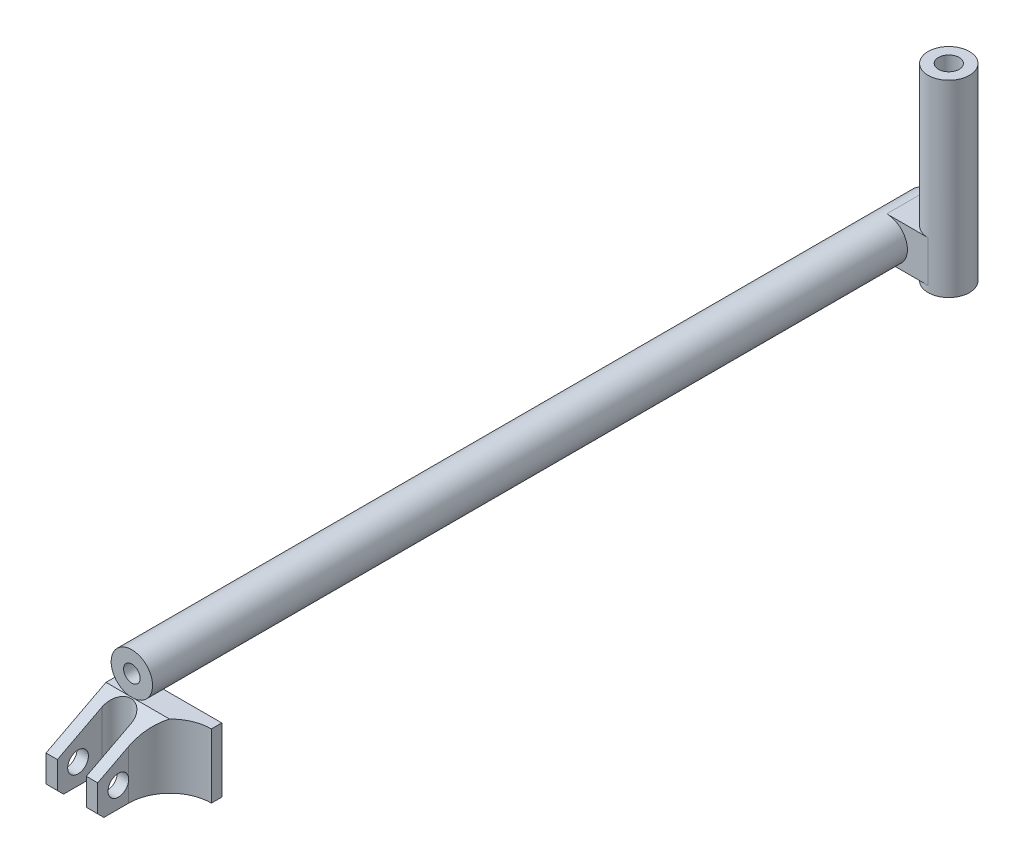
ISO-10303-21;
HEADER;
FILE_DESCRIPTION(('STEP AP214'),'2;1');
FILE_NAME('part.step','',(''),(''),'','','');
FILE_SCHEMA(('AUTOMOTIVE_DESIGN { 1 0 10303 214 1 1 1 1 }'));
ENDSEC;
DATA;
#1=APPLICATION_CONTEXT('core data for automotive mechanical design processes');
#2=APPLICATION_PROTOCOL_DEFINITION('international standard','automotive_design',2000,#1);
#3=PRODUCT_CONTEXT('',#1,'mechanical');
#4=PRODUCT('Part','Part','',(#3));
#5=PRODUCT_RELATED_PRODUCT_CATEGORY('part','',(#4));
#6=PRODUCT_DEFINITION_FORMATION('','',#4);
#7=PRODUCT_DEFINITION_CONTEXT('part definition',#1,'design');
#8=PRODUCT_DEFINITION('design','',#6,#7);
#9=PRODUCT_DEFINITION_SHAPE('','',#8);
#10=(LENGTH_UNIT() NAMED_UNIT(*) SI_UNIT(.MILLI.,.METRE.));
#11=(NAMED_UNIT(*) PLANE_ANGLE_UNIT() SI_UNIT($,.RADIAN.));
#12=(NAMED_UNIT(*) SI_UNIT($,.STERADIAN.) SOLID_ANGLE_UNIT());
#13=UNCERTAINTY_MEASURE_WITH_UNIT(LENGTH_MEASURE(1.E-05),#10,'distance_accuracy_value','');
#14=(GEOMETRIC_REPRESENTATION_CONTEXT(3) GLOBAL_UNCERTAINTY_ASSIGNED_CONTEXT((#13)) GLOBAL_UNIT_ASSIGNED_CONTEXT((#10,
#11,#12)) REPRESENTATION_CONTEXT('',''));
#15=CARTESIAN_POINT('',(0.,0.,0.));
#16=DIRECTION('',(0.,0.,1.));
#17=DIRECTION('',(1.,0.,0.));
#18=AXIS2_PLACEMENT_3D('',#15,#16,#17);
#19=CARTESIAN_POINT('',(25.,0.,0.));
#20=DIRECTION('',(0.,0.,1.));
#21=DIRECTION('',(-1.,0.,0.));
#22=AXIS2_PLACEMENT_3D('',#19,#20,#21);
#23=CYLINDRICAL_SURFACE('',#22,8.);
#24=CARTESIAN_POINT('',(25.,0.,365.));
#25=DIRECTION('',(0.,0.,-1.));
#26=DIRECTION('',(-1.,0.,0.));
#27=AXIS2_PLACEMENT_3D('',#24,#25,#26);
#28=CIRCLE('',#27,8.);
#29=CARTESIAN_POINT('',(17.,0.,365.));
#30=VERTEX_POINT('',#29);
#31=EDGE_CURVE('E36',#30,#30,#28,.F.);
#32=ORIENTED_EDGE('',*,*,#31,.T.);
#33=EDGE_LOOP('',(#32));
#34=FACE_BOUND('',#33,.T.);
#35=CARTESIAN_POINT('',(33.,1.11022302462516E-13,5.));
#36=CARTESIAN_POINT('',(32.9999996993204,-0.127079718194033,5.00000029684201));
#37=CARTESIAN_POINT('',(32.9969652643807,-0.254165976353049,5.00485122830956));
#38=CARTESIAN_POINT('',(32.9849016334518,-0.507365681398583,5.02418745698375));
#39=CARTESIAN_POINT('',(32.9758698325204,-0.633478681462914,5.03867694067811));
#40=CARTESIAN_POINT('',(32.9520184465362,-0.883879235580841,5.0771121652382));
#41=CARTESIAN_POINT('',(32.9371907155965,-1.00816396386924,5.10107121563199));
#42=CARTESIAN_POINT('',(32.9021008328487,-1.2538800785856,5.1581302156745));
#43=CARTESIAN_POINT('',(32.8818363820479,-1.37531023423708,5.19123403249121));
#44=CARTESIAN_POINT('',(32.8364650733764,-1.6138367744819,5.2659676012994));
#45=CARTESIAN_POINT('',(32.8113851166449,-1.73095311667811,5.30755006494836));
#46=CARTESIAN_POINT('',(32.7568549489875,-1.96091650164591,5.39889847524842));
#47=CARTESIAN_POINT('',(32.7274030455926,-2.07376186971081,5.44866759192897));
#48=CARTESIAN_POINT('',(32.6334070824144,-2.40491190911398,5.60949664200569));
#49=CARTESIAN_POINT('',(32.5631697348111,-2.61609848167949,5.73216345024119));
#50=CARTESIAN_POINT('',(32.4068029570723,-3.03193014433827,6.01555395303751));
#51=CARTESIAN_POINT('',(32.3198523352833,-3.23470598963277,6.17853453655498));
#52=CARTESIAN_POINT('',(32.1412401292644,-3.61195776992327,6.53289939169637));
#53=CARTESIAN_POINT('',(32.0495723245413,-3.78639500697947,6.72432183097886));
#54=CARTESIAN_POINT('',(31.9083621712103,-4.03551059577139,7.04428574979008));
#55=CARTESIAN_POINT('',(31.8577220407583,-4.12074022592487,7.16428713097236));
#56=CARTESIAN_POINT('',(31.7589964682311,-4.28074637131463,7.41215103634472));
#57=CARTESIAN_POINT('',(31.7109115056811,-4.35552092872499,7.54001502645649));
#58=CARTESIAN_POINT('',(31.6190767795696,-4.49385262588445,7.80288418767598));
#59=CARTESIAN_POINT('',(31.5753203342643,-4.55742717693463,7.93787784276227));
#60=CARTESIAN_POINT('',(31.4938515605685,-4.67278116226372,8.21462244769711));
#61=CARTESIAN_POINT('',(31.4561392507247,-4.72456056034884,8.35637341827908));
#62=CARTESIAN_POINT('',(31.3973773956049,-4.80367778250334,8.60813358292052));
#63=CARTESIAN_POINT('',(31.3745432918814,-4.83387146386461,8.71683605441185));
#64=CARTESIAN_POINT('',(31.3339131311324,-4.88698936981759,8.93691914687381));
#65=CARTESIAN_POINT('',(31.3161159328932,-4.90991524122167,9.04829915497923));
#66=CARTESIAN_POINT('',(31.2861900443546,-4.94817199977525,9.27297633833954));
#67=CARTESIAN_POINT('',(31.2740546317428,-4.96351189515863,9.38627107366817));
#68=CARTESIAN_POINT('',(31.2558765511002,-4.98640391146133,9.6141412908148));
#69=CARTESIAN_POINT('',(31.2498341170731,-4.99395573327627,9.72871682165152));
#70=CARTESIAN_POINT('',(31.2440762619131,-5.00115324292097,9.9585586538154));
#71=CARTESIAN_POINT('',(31.2443763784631,-5.0007795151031,10.0738259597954));
#72=CARTESIAN_POINT('',(31.2513301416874,-4.99208386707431,10.3039059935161));
#73=CARTESIAN_POINT('',(31.257986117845,-4.98375903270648,10.4187185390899));
#74=CARTESIAN_POINT('',(31.2773958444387,-4.95928874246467,10.6470210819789));
#75=CARTESIAN_POINT('',(31.2901515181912,-4.94314081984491,10.7605106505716));
#76=CARTESIAN_POINT('',(31.3212780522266,-4.90327193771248,10.9853862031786));
#77=CARTESIAN_POINT('',(31.3396512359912,-4.87954784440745,11.0967712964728));
#78=CARTESIAN_POINT('',(31.4012993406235,-4.79874186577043,11.4216199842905));
#79=CARTESIAN_POINT('',(31.4516270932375,-4.73140686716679,11.6312924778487));
#80=CARTESIAN_POINT('',(31.5658241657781,-4.57160139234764,12.0366820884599));
#81=CARTESIAN_POINT('',(31.6296982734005,-4.4791220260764,12.2323942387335));
#82=CARTESIAN_POINT('',(31.7781897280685,-4.25180409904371,12.6433146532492));
#83=CARTESIAN_POINT('',(31.8644530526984,-4.11227978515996,12.855335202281));
#84=CARTESIAN_POINT('',(32.0402390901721,-3.80349790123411,13.2553491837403));
#85=CARTESIAN_POINT('',(32.1297650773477,-3.63420977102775,13.443317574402));
#86=CARTESIAN_POINT('',(32.2682522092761,-3.34462792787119,13.7195685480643));
#87=CARTESIAN_POINT('',(32.3185662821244,-3.23332743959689,13.816742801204));
#88=CARTESIAN_POINT('',(32.4165140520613,-3.00184758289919,14.0013511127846));
#89=CARTESIAN_POINT('',(32.4641487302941,-2.88167150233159,14.0887887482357));
#90=CARTESIAN_POINT('',(32.5554827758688,-2.63291547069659,14.2532332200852));
#91=CARTESIAN_POINT('',(32.5991810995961,-2.5043333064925,14.3302372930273));
#92=CARTESIAN_POINT('',(32.6813840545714,-2.23953943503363,14.4729252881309));
#93=CARTESIAN_POINT('',(32.7198918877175,-2.10333250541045,14.5386161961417));
#94=CARTESIAN_POINT('',(32.7887019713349,-1.83158498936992,14.6546688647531));
#95=CARTESIAN_POINT('',(32.8193327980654,-1.69639792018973,14.7056622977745));
#96=CARTESIAN_POINT('',(32.874041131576,-1.42097512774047,14.796020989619));
#97=CARTESIAN_POINT('',(32.8981223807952,-1.28074233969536,14.8353928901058));
#98=CARTESIAN_POINT('',(32.9389934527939,-0.996484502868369,14.9018673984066));
#99=CARTESIAN_POINT('',(32.9557898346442,-0.852462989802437,14.9289810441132));
#100=CARTESIAN_POINT('',(32.9815729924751,-0.561915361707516,14.970490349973));
#101=CARTESIAN_POINT('',(32.9905611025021,-0.415389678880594,14.9848881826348));
#102=CARTESIAN_POINT('',(32.9996986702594,-0.143238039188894,14.999520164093));
#103=CARTESIAN_POINT('',(33.0009629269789,-0.0177414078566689,15.001540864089));
#104=CARTESIAN_POINT('',(32.997589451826,0.232966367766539,14.9961427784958));
#105=CARTESIAN_POINT('',(32.9929521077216,0.358177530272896,14.9887246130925));
#106=CARTESIAN_POINT('',(32.9778900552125,0.607327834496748,14.9645562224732));
#107=CARTESIAN_POINT('',(32.9674658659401,0.731267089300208,14.9478068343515));
#108=CARTESIAN_POINT('',(32.9410830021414,0.976969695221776,14.9052093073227));
#109=CARTESIAN_POINT('',(32.9251242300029,1.09873300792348,14.87936100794));
#110=CARTESIAN_POINT('',(32.8887734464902,1.33450834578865,14.8200905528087));
#111=CARTESIAN_POINT('',(32.8685811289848,1.44863666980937,14.7870073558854));
#112=CARTESIAN_POINT('',(32.8238453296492,1.6735023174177,14.7131109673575));
#113=CARTESIAN_POINT('',(32.7993003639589,1.7842384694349,14.6722951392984));
#114=CARTESIAN_POINT('',(32.7198451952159,2.11043845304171,14.5388502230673));
#115=CARTESIAN_POINT('',(32.6590855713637,2.32007565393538,14.4351772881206));
#116=CARTESIAN_POINT('',(32.5195949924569,2.74037159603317,14.1899279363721));
#117=CARTESIAN_POINT('',(32.439669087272,2.94899750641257,14.0455818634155));
#118=CARTESIAN_POINT('',(32.2722803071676,3.34056091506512,13.7288284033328));
#119=CARTESIAN_POINT('',(32.1848091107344,3.52346945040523,13.5563898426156));
#120=CARTESIAN_POINT('',(31.9962341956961,3.88590040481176,13.1594550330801));
#121=CARTESIAN_POINT('',(31.8949947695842,4.06107692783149,12.9310356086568));
#122=CARTESIAN_POINT('',(31.7026710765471,4.37121122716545,12.4445124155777));
#123=CARTESIAN_POINT('',(31.6115798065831,4.50619684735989,12.186429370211));
#124=CARTESIAN_POINT('',(31.469339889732,4.70739703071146,11.7011860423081));
#125=CARTESIAN_POINT('',(31.4138210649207,4.78209607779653,11.4788842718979));
#126=CARTESIAN_POINT('',(31.3465659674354,4.87056932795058,11.1364345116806));
#127=CARTESIAN_POINT('',(31.3268205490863,4.89612834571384,11.0208098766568));
#128=CARTESIAN_POINT('',(31.2933595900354,4.93906627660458,10.787213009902));
#129=CARTESIAN_POINT('',(31.279641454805,4.95644870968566,10.6692418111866));
#130=CARTESIAN_POINT('',(31.2587264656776,4.98283345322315,10.431062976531));
#131=CARTESIAN_POINT('',(31.2515693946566,4.99178464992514,10.3108461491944));
#132=CARTESIAN_POINT('',(31.2442275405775,5.00096567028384,10.0698650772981));
#133=CARTESIAN_POINT('',(31.2440427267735,5.00119553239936,9.94910083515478));
#134=CARTESIAN_POINT('',(31.250658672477,4.99292458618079,9.70802447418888));
#135=CARTESIAN_POINT('',(31.257461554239,4.98442112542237,9.58771250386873));
#136=CARTESIAN_POINT('',(31.2777455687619,4.95884706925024,9.34860633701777));
#137=CARTESIAN_POINT('',(31.2912266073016,4.94177659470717,9.22981211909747));
#138=CARTESIAN_POINT('',(31.3382277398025,4.88153513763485,8.89602861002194));
#139=CARTESIAN_POINT('',(31.3790757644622,4.82847742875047,8.68376223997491));
#140=CARTESIAN_POINT('',(31.4766977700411,4.69670428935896,8.27142029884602));
#141=CARTESIAN_POINT('',(31.5334783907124,4.61797815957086,8.07134985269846));
#142=CARTESIAN_POINT('',(31.666557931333,4.42410573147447,7.65762443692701));
#143=CARTESIAN_POINT('',(31.7444924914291,4.30533683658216,7.4461960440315));
#144=CARTESIAN_POINT('',(31.9067049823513,4.0400096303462,7.04424929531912));
#145=CARTESIAN_POINT('',(31.990988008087,3.8934288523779,6.85374804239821));
#146=CARTESIAN_POINT('',(32.1760899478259,3.54264024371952,6.45991603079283));
#147=CARTESIAN_POINT('',(32.2768764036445,3.33276887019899,6.26152210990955));
#148=CARTESIAN_POINT('',(32.420183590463,2.99268031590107,5.99189976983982));
#149=CARTESIAN_POINT('',(32.4666796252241,2.8749841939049,5.90662168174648));
#150=CARTESIAN_POINT('',(32.5558801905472,2.63162062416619,5.7460851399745));
#151=CARTESIAN_POINT('',(32.5985866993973,2.5059573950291,5.67082144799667));
#152=CARTESIAN_POINT('',(32.6791688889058,2.24695585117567,5.53089372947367));
#153=CARTESIAN_POINT('',(32.7170326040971,2.11359966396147,5.46625584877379));
#154=CARTESIAN_POINT('',(32.7867074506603,1.84039127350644,5.34864993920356));
#155=CARTESIAN_POINT('',(32.818522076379,1.70054287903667,5.29567517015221));
#156=CARTESIAN_POINT('',(32.8750664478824,1.41574969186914,5.20228711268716));
#157=CARTESIAN_POINT('',(32.8998152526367,1.27081981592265,5.16184000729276));
#158=CARTESIAN_POINT('',(32.9415135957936,0.976912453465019,5.09404896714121));
#159=CARTESIAN_POINT('',(32.9584688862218,0.827938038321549,5.06669536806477));
#160=CARTESIAN_POINT('',(32.9807660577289,0.56570803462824,5.03081849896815));
#161=CARTESIAN_POINT('',(32.9879654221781,0.453012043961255,5.01927449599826));
#162=CARTESIAN_POINT('',(32.9975826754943,0.226879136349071,5.00386487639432));
#163=CARTESIAN_POINT('',(33.0000002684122,0.113442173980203,4.99999973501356));
#164=CARTESIAN_POINT('',(33.,1.11022302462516E-13,5.));
#165=B_SPLINE_CURVE_WITH_KNOTS('',3,(#35,#36,#37,#38,#39,#40,#41,#42,#43,#44,#45,#46,#47,#48,
#49,#50,#51,#52,#53,#54,#55,#56,#57,#58,#59,#60,#61,#62,#63,#64,#65,#66,#67,#68,#69,#70,#71,#72,
#73,#74,#75,#76,#77,#78,#79,#80,#81,#82,#83,#84,#85,#86,#87,#88,#89,#90,#91,#92,#93,#94,#95,#96,
#97,#98,#99,#100,#101,#102,#103,#104,#105,#106,#107,#108,#109,#110,#111,#112,#113,#114,#115,
#116,#117,#118,#119,#120,#121,#122,#123,#124,#125,#126,#127,#128,#129,#130,#131,#132,#133,#134,
#135,#136,#137,#138,#139,#140,#141,#142,#143,#144,#145,#146,#147,#148,#149,#150,#151,#152,#153,
#154,#155,#156,#157,#158,#159,#160,#161,#162,#163,#164),.UNSPECIFIED.,.T.,.F.,(4,2,2,2,2,2,2,2,
2,2,2,2,2,2,2,2,2,2,2,2,2,2,2,2,2,2,2,2,2,2,2,2,2,2,2,2,2,2,2,2,2,2,2,2,2,2,2,2,2,2,2,2,2,2,2,2,
2,2,2,2,2,2,2,2,4),(0.,0.381122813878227,0.762411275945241,1.14423755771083,1.52622555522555,
1.90613865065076,2.28619920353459,3.04547146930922,3.86537873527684,4.68639638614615,
5.15288943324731,5.61946971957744,6.08531814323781,6.55116799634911,6.89615022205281,
7.24105422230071,7.58554766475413,7.93005433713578,8.27540506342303,8.62088241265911,
8.96646876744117,9.31219825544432,9.98712845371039,10.6622975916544,11.463592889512,
12.2657157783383,12.7334704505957,13.2010527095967,13.6687585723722,14.1361745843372,
14.5786070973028,15.0207862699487,15.4625664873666,15.9042712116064,16.280349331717,
16.6564027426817,17.0324224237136,17.4084487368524,17.7696430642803,18.1309607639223,
18.8530325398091,19.6479898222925,20.4438353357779,21.355208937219,22.2659496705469,
22.9857781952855,23.3455439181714,23.705154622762,24.0669316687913,24.4287071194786,
24.7905924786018,25.1524727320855,25.8172983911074,26.4824015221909,27.2437925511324,
28.005801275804,28.9187931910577,29.3761295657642,29.8332257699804,30.2914303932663,
30.749369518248,31.2060614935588,31.6624158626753,32.0026174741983,32.3428401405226),.UNSPECIFIED.);
#166=CARTESIAN_POINT('',(33.,1.11022302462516E-13,5.));
#167=VERTEX_POINT('',#166);
#168=EDGE_CURVE('E196',#167,#167,#165,.T.);
#169=ORIENTED_EDGE('',*,*,#168,.F.);
#170=EDGE_LOOP('',(#169));
#171=FACE_BOUND('',#170,.T.);
#172=CARTESIAN_POINT('',(25.,0.,3.));
#173=DIRECTION('',(0.,0.,1.));
#174=DIRECTION('',(1.,0.,0.));
#175=AXIS2_PLACEMENT_3D('',#172,#173,#174);
#176=CIRCLE('',#175,8.);
#177=CARTESIAN_POINT('',(33.,0.,3.));
#178=VERTEX_POINT('',#177);
#179=EDGE_CURVE('E11',#178,#178,#176,.F.);
#180=ORIENTED_EDGE('',*,*,#179,.T.);
#181=EDGE_LOOP('',(#180));
#182=FACE_BOUND('',#181,.T.);
#183=ADVANCED_FACE('F28',(#34,#171,#182),#23,.F.);
#184=CARTESIAN_POINT('',(50.,1.11022302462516E-13,10.));
#185=DIRECTION('',(-1.,0.,0.));
#186=DIRECTION('',(0.,0.,-1.));
#187=AXIS2_PLACEMENT_3D('',#184,#185,#186);
#188=CYLINDRICAL_SURFACE('',#187,5.);
#189=ORIENTED_EDGE('',*,*,#168,.T.);
#190=EDGE_LOOP('',(#189));
#191=FACE_BOUND('',#190,.T.);
#192=CARTESIAN_POINT('',(45.,1.11022302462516E-13,10.));
#193=DIRECTION('',(0.707106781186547,0.707106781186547,0.));
#194=DIRECTION('',(-0.707106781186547,0.707106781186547,0.));
#195=AXIS2_PLACEMENT_3D('',#192,#193,#194);
#196=ELLIPSE('',#195,7.07106781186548,5.);
#197=CARTESIAN_POINT('',(45.,1.11022302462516E-13,15.));
#198=VERTEX_POINT('',#197);
#199=CARTESIAN_POINT('',(45.,1.11022302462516E-13,5.));
#200=VERTEX_POINT('',#199);
#201=EDGE_CURVE('E183',#198,#200,#196,.F.);
#202=ORIENTED_EDGE('',*,*,#201,.F.);
#203=CARTESIAN_POINT('',(45.,1.11022302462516E-13,10.));
#204=DIRECTION('',(0.707106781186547,-0.707106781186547,0.));
#205=DIRECTION('',(-0.707106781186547,-0.707106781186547,0.));
#206=AXIS2_PLACEMENT_3D('',#203,#204,#205);
#207=ELLIPSE('',#206,7.07106781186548,5.);
#208=EDGE_CURVE('E176',#200,#198,#207,.F.);
#209=ORIENTED_EDGE('',*,*,#208,.F.);
#210=EDGE_LOOP('',(#202,#209));
#211=FACE_BOUND('',#210,.T.);
#212=ADVANCED_FACE('F386',(#191,#211),#188,.F.);
#213=CARTESIAN_POINT('',(57.5,-25.,414.));
#214=DIRECTION('',(0.,0.,1.));
#215=DIRECTION('',(-1.,0.,0.));
#216=AXIS2_PLACEMENT_3D('',#213,#214,#215);
#217=PLANE('',#216);
#218=DIRECTION('',(0.,1.,0.));
#219=VECTOR('',#218,1.);
#220=CARTESIAN_POINT('',(18.,-25.,414.));
#221=LINE('',#220,#219);
#222=CARTESIAN_POINT('',(18.,-38.,414.));
#223=VERTEX_POINT('',#222);
#224=CARTESIAN_POINT('',(18.,-25.,414.));
#225=VERTEX_POINT('',#224);
#226=EDGE_CURVE('E234',#223,#225,#221,.T.);
#227=ORIENTED_EDGE('',*,*,#226,.T.);
#228=DIRECTION('',(-1.,0.,0.));
#229=VECTOR('',#228,1.);
#230=CARTESIAN_POINT('',(57.5,-25.,414.));
#231=LINE('',#230,#229);
#232=CARTESIAN_POINT('',(12.5,-25.,414.));
#233=VERTEX_POINT('',#232);
#234=EDGE_CURVE('E286',#225,#233,#231,.T.);
#235=ORIENTED_EDGE('',*,*,#234,.T.);
#236=DIRECTION('',(0.,-1.,0.));
#237=VECTOR('',#236,1.);
#238=CARTESIAN_POINT('',(12.5,-25.,414.));
#239=LINE('',#238,#237);
#240=CARTESIAN_POINT('',(12.5,-38.,414.));
#241=VERTEX_POINT('',#240);
#242=EDGE_CURVE('E259',#233,#241,#239,.T.);
#243=ORIENTED_EDGE('',*,*,#242,.T.);
#244=DIRECTION('',(-1.,0.,0.));
#245=VECTOR('',#244,1.);
#246=CARTESIAN_POINT('',(57.5,-38.,414.));
#247=LINE('',#246,#245);
#248=EDGE_CURVE('E354',#223,#241,#247,.T.);
#249=ORIENTED_EDGE('',*,*,#248,.F.);
#250=EDGE_LOOP('',(#227,#235,#243,#249));
#251=FACE_BOUND('',#250,.T.);
#252=ADVANCED_FACE('F445',(#251),#217,.T.);
#253=CARTESIAN_POINT('',(45.,10.,10.));
#254=DIRECTION('',(0.,1.,0.));
#255=DIRECTION('',(0.,0.,1.));
#256=AXIS2_PLACEMENT_3D('',#253,#254,#255);
#257=PLANE('',#256);
#258=DIRECTION('',(1.,0.,0.));
#259=VECTOR('',#258,1.);
#260=CARTESIAN_POINT('',(45.,10.,0.));
#261=LINE('',#260,#259);
#262=CARTESIAN_POINT('',(25.,10.,0.));
#263=VERTEX_POINT('',#262);
#264=CARTESIAN_POINT('',(45.,10.,0.));
#265=VERTEX_POINT('',#264);
#266=EDGE_CURVE('E321',#263,#265,#261,.T.);
#267=ORIENTED_EDGE('',*,*,#266,.F.);
#268=DIRECTION('',(0.,0.,-1.));
#269=VECTOR('',#268,1.);
#270=CARTESIAN_POINT('',(25.,10.,0.));
#271=LINE('',#270,#269);
#272=CARTESIAN_POINT('',(25.,10.,20.));
#273=VERTEX_POINT('',#272);
#274=EDGE_CURVE('E318',#273,#263,#271,.T.);
#275=ORIENTED_EDGE('',*,*,#274,.F.);
#276=DIRECTION('',(-1.,0.,0.));
#277=VECTOR('',#276,1.);
#278=CARTESIAN_POINT('',(45.,10.,20.));
#279=LINE('',#278,#277);
#280=CARTESIAN_POINT('',(45.,10.,20.));
#281=VERTEX_POINT('',#280);
#282=EDGE_CURVE('E315',#281,#273,#279,.T.);
#283=ORIENTED_EDGE('',*,*,#282,.F.);
#284=CARTESIAN_POINT('',(45.,10.,10.));
#285=DIRECTION('',(0.,-1.,0.));
#286=DIRECTION('',(0.,0.,1.));
#287=AXIS2_PLACEMENT_3D('',#284,#285,#286);
#288=CIRCLE('',#287,10.);
#289=EDGE_CURVE('E294',#281,#265,#288,.T.);
#290=ORIENTED_EDGE('',*,*,#289,.T.);
#291=EDGE_LOOP('',(#267,#275,#283,#290));
#292=FACE_BOUND('',#291,.T.);
#293=ADVANCED_FACE('F463',(#292),#257,.T.);
#294=CARTESIAN_POINT('',(45.,-10.,10.));
#295=DIRECTION('',(0.,1.,0.));
#296=DIRECTION('',(0.,0.,1.));
#297=AXIS2_PLACEMENT_3D('',#294,#295,#296);
#298=PLANE('',#297);
#299=CARTESIAN_POINT('',(45.,-10.,10.));
#300=DIRECTION('',(0.,1.,0.));
#301=DIRECTION('',(0.,0.,-1.));
#302=AXIS2_PLACEMENT_3D('',#299,#300,#301);
#303=CIRCLE('',#302,10.);
#304=CARTESIAN_POINT('',(45.,-10.,0.));
#305=VERTEX_POINT('',#304);
#306=CARTESIAN_POINT('',(45.,-10.,20.));
#307=VERTEX_POINT('',#306);
#308=EDGE_CURVE('E300',#305,#307,#303,.T.);
#309=ORIENTED_EDGE('',*,*,#308,.T.);
#310=DIRECTION('',(-1.,0.,0.));
#311=VECTOR('',#310,1.);
#312=CARTESIAN_POINT('',(45.,-10.,20.));
#313=LINE('',#312,#311);
#314=CARTESIAN_POINT('',(25.,-10.,20.));
#315=VERTEX_POINT('',#314);
#316=EDGE_CURVE('E306',#307,#315,#313,.T.);
#317=ORIENTED_EDGE('',*,*,#316,.T.);
#318=DIRECTION('',(0.,0.,-1.));
#319=VECTOR('',#318,1.);
#320=CARTESIAN_POINT('',(25.,-10.,0.));
#321=LINE('',#320,#319);
#322=CARTESIAN_POINT('',(25.,-10.,0.));
#323=VERTEX_POINT('',#322);
#324=EDGE_CURVE('E309',#315,#323,#321,.T.);
#325=ORIENTED_EDGE('',*,*,#324,.T.);
#326=DIRECTION('',(1.,0.,0.));
#327=VECTOR('',#326,1.);
#328=CARTESIAN_POINT('',(45.,-10.,0.));
#329=LINE('',#328,#327);
#330=EDGE_CURVE('E312',#323,#305,#329,.T.);
#331=ORIENTED_EDGE('',*,*,#330,.T.);
#332=EDGE_LOOP('',(#309,#317,#325,#331));
#333=FACE_BOUND('',#332,.T.);
#334=ADVANCED_FACE('F460',(#333),#298,.F.);
#335=CARTESIAN_POINT('',(25.,0.,385.));
#336=DIRECTION('',(0.,0.,-1.));
#337=DIRECTION('',(1.,0.,0.));
#338=AXIS2_PLACEMENT_3D('',#335,#336,#337);
#339=CYLINDRICAL_SURFACE('',#338,10.);
#340=CARTESIAN_POINT('',(25.,0.,385.));
#341=DIRECTION('',(0.,0.,-1.));
#342=DIRECTION('',(-1.,0.,0.));
#343=AXIS2_PLACEMENT_3D('',#340,#341,#342);
#344=CIRCLE('',#343,10.);
#345=CARTESIAN_POINT('',(23.7309886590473,-9.91915370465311,385.));
#346=VERTEX_POINT('',#345);
#347=CARTESIAN_POINT('',(26.2690113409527,-9.91915370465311,385.));
#348=VERTEX_POINT('',#347);
#349=EDGE_CURVE('E330',#346,#348,#344,.T.);
#350=ORIENTED_EDGE('',*,*,#349,.T.);
#351=DIRECTION('',(0.,0.,-1.));
#352=VECTOR('',#351,1.);
#353=CARTESIAN_POINT('',(26.2690113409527,-9.91915370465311,385.));
#354=LINE('',#353,#352);
#355=CARTESIAN_POINT('',(26.2690113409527,-9.9191537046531,374.));
#356=VERTEX_POINT('',#355);
#357=EDGE_CURVE('E278',#356,#348,#354,.F.);
#358=ORIENTED_EDGE('',*,*,#357,.F.);
#359=CARTESIAN_POINT('',(25.,0.,374.));
#360=DIRECTION('',(0.,0.,1.));
#361=DIRECTION('',(1.,0.,0.));
#362=AXIS2_PLACEMENT_3D('',#359,#360,#361);
#363=CIRCLE('',#362,10.);
#364=CARTESIAN_POINT('',(23.7309886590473,-9.9191537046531,374.));
#365=VERTEX_POINT('',#364);
#366=EDGE_CURVE('E338',#365,#356,#363,.T.);
#367=ORIENTED_EDGE('',*,*,#366,.F.);
#368=DIRECTION('',(0.,0.,-1.));
#369=VECTOR('',#368,1.);
#370=CARTESIAN_POINT('',(23.7309886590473,-9.91915370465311,385.));
#371=LINE('',#370,#369);
#372=EDGE_CURVE('E291',#346,#365,#371,.T.);
#373=ORIENTED_EDGE('',*,*,#372,.F.);
#374=EDGE_LOOP('',(#350,#358,#367,#373));
#375=FACE_BOUND('',#374,.T.);
#376=ORIENTED_EDGE('',*,*,#274,.T.);
#377=CARTESIAN_POINT('',(25.,0.,0.));
#378=DIRECTION('',(0.,0.,-1.));
#379=DIRECTION('',(-1.,0.,0.));
#380=AXIS2_PLACEMENT_3D('',#377,#378,#379);
#381=CIRCLE('',#380,10.);
#382=EDGE_CURVE('E328',#323,#263,#381,.T.);
#383=ORIENTED_EDGE('',*,*,#382,.F.);
#384=ORIENTED_EDGE('',*,*,#324,.F.);
#385=CARTESIAN_POINT('',(25.,0.,20.));
#386=DIRECTION('',(0.,0.,1.));
#387=DIRECTION('',(1.,0.,0.));
#388=AXIS2_PLACEMENT_3D('',#385,#386,#387);
#389=CIRCLE('',#388,10.);
#390=EDGE_CURVE('E333',#315,#273,#389,.T.);
#391=ORIENTED_EDGE('',*,*,#390,.T.);
#392=EDGE_LOOP('',(#376,#383,#384,#391));
#393=FACE_BOUND('',#392,.T.);
#394=ADVANCED_FACE('F30',(#375,#393),#339,.T.);
#395=CARTESIAN_POINT('',(25.,0.,385.));
#396=DIRECTION('',(0.,0.,1.));
#397=DIRECTION('',(-1.,0.,0.));
#398=AXIS2_PLACEMENT_3D('',#395,#396,#397);
#399=PLANE('',#398);
#400=DIRECTION('',(1.,0.,0.));
#401=VECTOR('',#400,1.);
#402=CARTESIAN_POINT('',(25.,-9.91915370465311,385.));
#403=LINE('',#402,#401);
#404=EDGE_CURVE('E335',#346,#348,#403,.T.);
#405=ORIENTED_EDGE('',*,*,#404,.T.);
#406=ORIENTED_EDGE('',*,*,#349,.F.);
#407=EDGE_LOOP('',(#405,#406));
#408=FACE_BOUND('',#407,.T.);
#409=CARTESIAN_POINT('',(25.,0.,385.));
#410=DIRECTION('',(0.,0.,-1.));
#411=DIRECTION('',(-1.,0.,0.));
#412=AXIS2_PLACEMENT_3D('',#409,#410,#411);
#413=CIRCLE('',#412,4.);
#414=CARTESIAN_POINT('',(21.,0.,385.));
#415=VERTEX_POINT('',#414);
#416=EDGE_CURVE('E202',#415,#415,#413,.T.);
#417=ORIENTED_EDGE('',*,*,#416,.T.);
#418=EDGE_LOOP('',(#417));
#419=FACE_BOUND('',#418,.T.);
#420=ADVANCED_FACE('F477',(#408,#419),#399,.T.);
#421=CARTESIAN_POINT('',(25.,0.,0.));
#422=DIRECTION('',(0.,0.,1.));
#423=DIRECTION('',(-1.,0.,0.));
#424=AXIS2_PLACEMENT_3D('',#421,#422,#423);
#425=PLANE('',#424);
#426=ORIENTED_EDGE('',*,*,#382,.T.);
#427=ORIENTED_EDGE('',*,*,#266,.T.);
#428=DIRECTION('',(0.,-1.,0.));
#429=VECTOR('',#428,1.);
#430=CARTESIAN_POINT('',(45.,10.,0.));
#431=LINE('',#430,#429);
#432=EDGE_CURVE('E324',#265,#305,#431,.T.);
#433=ORIENTED_EDGE('',*,*,#432,.T.);
#434=ORIENTED_EDGE('',*,*,#330,.F.);
#435=EDGE_LOOP('',(#426,#427,#433,#434));
#436=FACE_BOUND('',#435,.T.);
#437=ADVANCED_FACE('F471',(#436),#425,.F.);
#438=CARTESIAN_POINT('',(45.,10.,20.));
#439=DIRECTION('',(0.,0.,-1.));
#440=DIRECTION('',(1.,0.,0.));
#441=AXIS2_PLACEMENT_3D('',#438,#439,#440);
#442=PLANE('',#441);
#443=ORIENTED_EDGE('',*,*,#316,.F.);
#444=DIRECTION('',(0.,-1.,0.));
#445=VECTOR('',#444,1.);
#446=CARTESIAN_POINT('',(45.,10.,20.));
#447=LINE('',#446,#445);
#448=EDGE_CURVE('E326',#281,#307,#447,.T.);
#449=ORIENTED_EDGE('',*,*,#448,.F.);
#450=ORIENTED_EDGE('',*,*,#282,.T.);
#451=ORIENTED_EDGE('',*,*,#390,.F.);
#452=EDGE_LOOP('',(#443,#449,#450,#451));
#453=FACE_BOUND('',#452,.T.);
#454=ADVANCED_FACE('F468',(#453),#442,.F.);
#455=CARTESIAN_POINT('',(45.,10.,10.));
#456=DIRECTION('',(0.,-1.,0.));
#457=DIRECTION('',(0.,0.,-1.));
#458=AXIS2_PLACEMENT_3D('',#455,#456,#457);
#459=CYLINDRICAL_SURFACE('',#458,10.);
#460=ORIENTED_EDGE('',*,*,#432,.F.);
#461=ORIENTED_EDGE('',*,*,#289,.F.);
#462=ORIENTED_EDGE('',*,*,#448,.T.);
#463=ORIENTED_EDGE('',*,*,#308,.F.);
#464=EDGE_LOOP('',(#460,#461,#462,#463));
#465=FACE_BOUND('',#464,.T.);
#466=CARTESIAN_POINT('',(45.,-13.,10.));
#467=DIRECTION('',(0.,1.,0.));
#468=DIRECTION('',(0.,0.,-1.));
#469=AXIS2_PLACEMENT_3D('',#466,#467,#468);
#470=CIRCLE('',#469,10.);
#471=CARTESIAN_POINT('',(45.,-13.,0.));
#472=VERTEX_POINT('',#471);
#473=EDGE_CURVE('E303',#472,#472,#470,.T.);
#474=ORIENTED_EDGE('',*,*,#473,.T.);
#475=EDGE_LOOP('',(#474));
#476=FACE_BOUND('',#475,.T.);
#477=CARTESIAN_POINT('',(45.,78.,10.));
#478=DIRECTION('',(0.,-1.,0.));
#479=DIRECTION('',(0.,0.,1.));
#480=AXIS2_PLACEMENT_3D('',#477,#478,#479);
#481=CIRCLE('',#480,10.);
#482=CARTESIAN_POINT('',(45.,78.,20.));
#483=VERTEX_POINT('',#482);
#484=EDGE_CURVE('E297',#483,#483,#481,.T.);
#485=ORIENTED_EDGE('',*,*,#484,.T.);
#486=EDGE_LOOP('',(#485));
#487=FACE_BOUND('',#486,.T.);
#488=ADVANCED_FACE('F458',(#465,#476,#487),#459,.T.);
#489=CARTESIAN_POINT('',(45.,-13.,10.));
#490=DIRECTION('',(0.,-1.,0.));
#491=DIRECTION('',(0.,0.,-1.));
#492=AXIS2_PLACEMENT_3D('',#489,#490,#491);
#493=PLANE('',#492);
#494=ORIENTED_EDGE('',*,*,#473,.F.);
#495=EDGE_LOOP('',(#494));
#496=FACE_BOUND('',#495,.T.);
#497=ADVANCED_FACE('F454',(#496),#493,.T.);
#498=CARTESIAN_POINT('',(45.,78.,10.));
#499=DIRECTION('',(0.,1.,0.));
#500=DIRECTION('',(0.,0.,1.));
#501=AXIS2_PLACEMENT_3D('',#498,#499,#500);
#502=PLANE('',#501);
#503=CARTESIAN_POINT('',(45.,78.,10.));
#504=DIRECTION('',(0.,-1.,0.));
#505=DIRECTION('',(0.,0.,1.));
#506=AXIS2_PLACEMENT_3D('',#503,#504,#505);
#507=CIRCLE('',#506,5.);
#508=CARTESIAN_POINT('',(45.,78.,15.));
#509=VERTEX_POINT('',#508);
#510=EDGE_CURVE('E540',#509,#509,#507,.T.);
#511=ORIENTED_EDGE('',*,*,#510,.T.);
#512=EDGE_LOOP('',(#511));
#513=FACE_BOUND('',#512,.T.);
#514=ORIENTED_EDGE('',*,*,#484,.F.);
#515=EDGE_LOOP('',(#514));
#516=FACE_BOUND('',#515,.T.);
#517=ADVANCED_FACE('F434',(#513,#516),#502,.T.);
#518=CARTESIAN_POINT('',(57.5,-41.,374.));
#519=DIRECTION('',(0.,0.,-1.));
#520=DIRECTION('',(1.,0.,0.));
#521=AXIS2_PLACEMENT_3D('',#518,#519,#520);
#522=PLANE('',#521);
#523=ORIENTED_EDGE('',*,*,#366,.T.);
#524=DIRECTION('',(-1.,0.,0.));
#525=VECTOR('',#524,1.);
#526=CARTESIAN_POINT('',(57.5,-9.91915370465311,374.));
#527=LINE('',#526,#525);
#528=CARTESIAN_POINT('',(57.5,-9.91915370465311,374.));
#529=VERTEX_POINT('',#528);
#530=EDGE_CURVE('E276',#529,#356,#527,.T.);
#531=ORIENTED_EDGE('',*,*,#530,.F.);
#532=DIRECTION('',(0.,1.,0.));
#533=VECTOR('',#532,1.);
#534=CARTESIAN_POINT('',(57.5,-41.,374.));
#535=LINE('',#534,#533);
#536=CARTESIAN_POINT('',(57.5,-41.,374.));
#537=VERTEX_POINT('',#536);
#538=EDGE_CURVE('E272',#537,#529,#535,.T.);
#539=ORIENTED_EDGE('',*,*,#538,.F.);
#540=DIRECTION('',(-1.,0.,0.));
#541=VECTOR('',#540,1.);
#542=CARTESIAN_POINT('',(57.5,-41.,374.));
#543=LINE('',#542,#541);
#544=CARTESIAN_POINT('',(12.5,-41.,374.));
#545=VERTEX_POINT('',#544);
#546=EDGE_CURVE('E280',#537,#545,#543,.T.);
#547=ORIENTED_EDGE('',*,*,#546,.T.);
#548=DIRECTION('',(0.,1.,0.));
#549=VECTOR('',#548,1.);
#550=CARTESIAN_POINT('',(12.5,-41.,374.));
#551=LINE('',#550,#549);
#552=CARTESIAN_POINT('',(12.5,-9.91915370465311,374.));
#553=VERTEX_POINT('',#552);
#554=EDGE_CURVE('E264',#545,#553,#551,.T.);
#555=ORIENTED_EDGE('',*,*,#554,.T.);
#556=EDGE_CURVE('E279',#365,#553,#527,.T.);
#557=ORIENTED_EDGE('',*,*,#556,.F.);
#558=EDGE_LOOP('',(#523,#531,#539,#547,#555,#557));
#559=FACE_BOUND('',#558,.T.);
#560=ADVANCED_FACE('F430',(#559),#522,.T.);
#561=CARTESIAN_POINT('',(57.5,-9.91915370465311,374.));
#562=DIRECTION('',(0.,1.,0.));
#563=DIRECTION('',(0.,0.,1.));
#564=AXIS2_PLACEMENT_3D('',#561,#562,#563);
#565=PLANE('',#564);
#566=ORIENTED_EDGE('',*,*,#372,.T.);
#567=ORIENTED_EDGE('',*,*,#556,.T.);
#568=DIRECTION('',(0.,0.,1.));
#569=VECTOR('',#568,1.);
#570=CARTESIAN_POINT('',(12.5,-9.91915370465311,374.));
#571=LINE('',#570,#569);
#572=CARTESIAN_POINT('',(12.5,-9.91915370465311,385.));
#573=VERTEX_POINT('',#572);
#574=EDGE_CURVE('E254',#553,#573,#571,.T.);
#575=ORIENTED_EDGE('',*,*,#574,.T.);
#576=DIRECTION('',(-1.,0.,0.));
#577=VECTOR('',#576,1.);
#578=CARTESIAN_POINT('',(57.5,-9.91915370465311,385.));
#579=LINE('',#578,#577);
#580=EDGE_CURVE('E275',#346,#573,#579,.T.);
#581=ORIENTED_EDGE('',*,*,#580,.F.);
#582=EDGE_LOOP('',(#566,#567,#575,#581));
#583=FACE_BOUND('',#582,.T.);
#584=ADVANCED_FACE('F433',(#583),#565,.T.);
#585=CARTESIAN_POINT('',(57.5,-9.9191537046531,399.));
#586=DIRECTION('',(0.,-1.,0.));
#587=DIRECTION('',(0.,0.,1.));
#588=AXIS2_PLACEMENT_3D('',#585,#586,#587);
#589=CIRCLE('',#588,20.);
#590=CARTESIAN_POINT('',(43.2171431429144,-9.91915370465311,385.));
#591=VERTEX_POINT('',#590);
#592=CARTESIAN_POINT('',(57.5,-9.91915370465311,379.));
#593=VERTEX_POINT('',#592);
#594=EDGE_CURVE('E248',#591,#593,#589,.T.);
#595=ORIENTED_EDGE('',*,*,#594,.T.);
#596=DIRECTION('',(0.,0.,1.));
#597=VECTOR('',#596,1.);
#598=CARTESIAN_POINT('',(57.5,-9.91915370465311,374.));
#599=LINE('',#598,#597);
#600=EDGE_CURVE('E267',#529,#593,#599,.T.);
#601=ORIENTED_EDGE('',*,*,#600,.F.);
#602=ORIENTED_EDGE('',*,*,#530,.T.);
#603=ORIENTED_EDGE('',*,*,#357,.T.);
#604=EDGE_CURVE('E287',#591,#348,#579,.T.);
#605=ORIENTED_EDGE('',*,*,#604,.F.);
#606=EDGE_LOOP('',(#595,#601,#602,#603,#605));
#607=FACE_BOUND('',#606,.T.);
#608=ADVANCED_FACE('F440',(#607),#565,.T.);
#609=CARTESIAN_POINT('',(57.5,-41.,414.));
#610=DIRECTION('',(0.,-1.,0.));
#611=DIRECTION('',(0.,0.,-1.));
#612=AXIS2_PLACEMENT_3D('',#609,#610,#611);
#613=PLANE('',#612);
#614=DIRECTION('',(0.,0.,-1.));
#615=VECTOR('',#614,1.);
#616=CARTESIAN_POINT('',(12.5,-41.,414.));
#617=LINE('',#616,#615);
#618=CARTESIAN_POINT('',(12.5,-41.,411.));
#619=VERTEX_POINT('',#618);
#620=EDGE_CURVE('E262',#619,#545,#617,.T.);
#621=ORIENTED_EDGE('',*,*,#620,.T.);
#622=ORIENTED_EDGE('',*,*,#546,.F.);
#623=DIRECTION('',(0.,0.,-1.));
#624=VECTOR('',#623,1.);
#625=CARTESIAN_POINT('',(57.5,-41.,414.));
#626=LINE('',#625,#624);
#627=CARTESIAN_POINT('',(57.5,-41.,379.));
#628=VERTEX_POINT('',#627);
#629=EDGE_CURVE('E270',#628,#537,#626,.T.);
#630=ORIENTED_EDGE('',*,*,#629,.F.);
#631=CARTESIAN_POINT('',(57.5,-41.,399.));
#632=DIRECTION('',(0.,1.,0.));
#633=DIRECTION('',(0.,0.,1.));
#634=AXIS2_PLACEMENT_3D('',#631,#632,#633);
#635=CIRCLE('',#634,20.);
#636=CARTESIAN_POINT('',(37.5,-41.,399.));
#637=VERTEX_POINT('',#636);
#638=EDGE_CURVE('E237',#628,#637,#635,.T.);
#639=ORIENTED_EDGE('',*,*,#638,.T.);
#640=DIRECTION('',(0.,0.,1.));
#641=VECTOR('',#640,1.);
#642=CARTESIAN_POINT('',(37.5,-41.,399.));
#643=LINE('',#642,#641);
#644=CARTESIAN_POINT('',(37.5,-41.,411.));
#645=VERTEX_POINT('',#644);
#646=EDGE_CURVE('E240',#637,#645,#643,.T.);
#647=ORIENTED_EDGE('',*,*,#646,.T.);
#648=DIRECTION('',(1.,0.,0.));
#649=VECTOR('',#648,1.);
#650=CARTESIAN_POINT('',(57.5,-41.,411.));
#651=LINE('',#650,#649);
#652=CARTESIAN_POINT('',(32.,-41.,411.));
#653=VERTEX_POINT('',#652);
#654=EDGE_CURVE('E361',#653,#645,#651,.T.);
#655=ORIENTED_EDGE('',*,*,#654,.F.);
#656=DIRECTION('',(0.,0.,-1.));
#657=VECTOR('',#656,1.);
#658=CARTESIAN_POINT('',(32.,-41.,420.621211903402));
#659=LINE('',#658,#657);
#660=CARTESIAN_POINT('',(32.,-41.,392.460683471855));
#661=VERTEX_POINT('',#660);
#662=EDGE_CURVE('E218',#653,#661,#659,.T.);
#663=ORIENTED_EDGE('',*,*,#662,.T.);
#664=CARTESIAN_POINT('',(25.,-41.,392.460683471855));
#665=DIRECTION('',(0.,1.,0.));
#666=DIRECTION('',(0.,0.,-1.));
#667=AXIS2_PLACEMENT_3D('',#664,#665,#666);
#668=CIRCLE('',#667,7.);
#669=CARTESIAN_POINT('',(18.,-41.,392.460683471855));
#670=VERTEX_POINT('',#669);
#671=EDGE_CURVE('E221',#661,#670,#668,.T.);
#672=ORIENTED_EDGE('',*,*,#671,.T.);
#673=DIRECTION('',(0.,0.,1.));
#674=VECTOR('',#673,1.);
#675=CARTESIAN_POINT('',(18.,-41.,420.621211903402));
#676=LINE('',#675,#674);
#677=CARTESIAN_POINT('',(18.,-41.,411.));
#678=VERTEX_POINT('',#677);
#679=EDGE_CURVE('E224',#670,#678,#676,.T.);
#680=ORIENTED_EDGE('',*,*,#679,.T.);
#681=DIRECTION('',(1.,0.,0.));
#682=VECTOR('',#681,1.);
#683=CARTESIAN_POINT('',(57.5,-41.,411.));
#684=LINE('',#683,#682);
#685=EDGE_CURVE('E363',#619,#678,#684,.T.);
#686=ORIENTED_EDGE('',*,*,#685,.F.);
#687=EDGE_LOOP('',(#621,#622,#630,#639,#647,#655,#663,#672,#680,#686));
#688=FACE_BOUND('',#687,.T.);
#689=ADVANCED_FACE('F436',(#688),#613,.T.);
#690=DIRECTION('',(0.,1.,0.));
#691=VECTOR('',#690,1.);
#692=CARTESIAN_POINT('',(37.5,-25.,414.));
#693=LINE('',#692,#691);
#694=CARTESIAN_POINT('',(37.5,-38.,414.));
#695=VERTEX_POINT('',#694);
#696=CARTESIAN_POINT('',(37.5,-25.,414.));
#697=VERTEX_POINT('',#696);
#698=EDGE_CURVE('E251',#695,#697,#693,.T.);
#699=ORIENTED_EDGE('',*,*,#698,.T.);
#700=CARTESIAN_POINT('',(32.,-25.,414.));
#701=VERTEX_POINT('',#700);
#702=EDGE_CURVE('E283',#697,#701,#231,.T.);
#703=ORIENTED_EDGE('',*,*,#702,.T.);
#704=DIRECTION('',(0.,-1.,0.));
#705=VECTOR('',#704,1.);
#706=CARTESIAN_POINT('',(32.,-25.,414.));
#707=LINE('',#706,#705);
#708=CARTESIAN_POINT('',(32.,-38.,414.));
#709=VERTEX_POINT('',#708);
#710=EDGE_CURVE('E230',#701,#709,#707,.T.);
#711=ORIENTED_EDGE('',*,*,#710,.T.);
#712=DIRECTION('',(-1.,0.,0.));
#713=VECTOR('',#712,1.);
#714=CARTESIAN_POINT('',(57.5,-38.,414.));
#715=LINE('',#714,#713);
#716=EDGE_CURVE('E368',#695,#709,#715,.T.);
#717=ORIENTED_EDGE('',*,*,#716,.F.);
#718=EDGE_LOOP('',(#699,#703,#711,#717));
#719=FACE_BOUND('',#718,.T.);
#720=ADVANCED_FACE('F439',(#719),#217,.T.);
#721=CARTESIAN_POINT('',(57.5,-9.91915370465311,385.));
#722=DIRECTION('',(0.,0.887206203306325,0.461373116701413));
#723=DIRECTION('',(0.,-0.461373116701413,0.887206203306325));
#724=AXIS2_PLACEMENT_3D('',#721,#722,#723);
#725=PLANE('',#724);
#726=DIRECTION('',(0.,0.461373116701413,-0.887206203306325));
#727=VECTOR('',#726,1.);
#728=CARTESIAN_POINT('',(18.,-9.91915370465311,385.));
#729=LINE('',#728,#727);
#730=CARTESIAN_POINT('',(18.,-13.7989268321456,392.460683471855));
#731=VERTEX_POINT('',#730);
#732=EDGE_CURVE('E351',#225,#731,#729,.T.);
#733=ORIENTED_EDGE('',*,*,#732,.T.);
#734=CARTESIAN_POINT('',(25.,-13.7989268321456,392.460683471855));
#735=DIRECTION('',(0.,-0.887206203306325,-0.461373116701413));
#736=DIRECTION('',(0.,-0.461373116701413,0.887206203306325));
#737=AXIS2_PLACEMENT_3D('',#734,#735,#736);
#738=ELLIPSE('',#737,7.88993581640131,7.);
#739=CARTESIAN_POINT('',(32.,-13.7989268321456,392.460683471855));
#740=VERTEX_POINT('',#739);
#741=EDGE_CURVE('E348',#731,#740,#738,.T.);
#742=ORIENTED_EDGE('',*,*,#741,.T.);
#743=DIRECTION('',(0.,-0.461373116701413,0.887206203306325));
#744=VECTOR('',#743,1.);
#745=CARTESIAN_POINT('',(32.,-9.91915370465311,385.));
#746=LINE('',#745,#744);
#747=EDGE_CURVE('E346',#740,#701,#746,.T.);
#748=ORIENTED_EDGE('',*,*,#747,.T.);
#749=ORIENTED_EDGE('',*,*,#702,.F.);
#750=DIRECTION('',(0.,0.461373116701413,-0.887206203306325));
#751=VECTOR('',#750,1.);
#752=CARTESIAN_POINT('',(37.5,-9.91915370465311,385.));
#753=LINE('',#752,#751);
#754=CARTESIAN_POINT('',(37.5,-17.1995622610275,399.));
#755=VERTEX_POINT('',#754);
#756=EDGE_CURVE('E343',#697,#755,#753,.T.);
#757=ORIENTED_EDGE('',*,*,#756,.T.);
#758=CARTESIAN_POINT('',(57.5,-17.1995622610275,399.));
#759=DIRECTION('',(0.,-0.887206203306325,-0.461373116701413));
#760=DIRECTION('',(0.,-0.461373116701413,0.887206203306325));
#761=AXIS2_PLACEMENT_3D('',#758,#759,#760);
#762=ELLIPSE('',#761,22.5426737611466,20.);
#763=EDGE_CURVE('E246',#755,#591,#762,.T.);
#764=ORIENTED_EDGE('',*,*,#763,.T.);
#765=ORIENTED_EDGE('',*,*,#604,.T.);
#766=ORIENTED_EDGE('',*,*,#404,.F.);
#767=ORIENTED_EDGE('',*,*,#580,.T.);
#768=DIRECTION('',(0.,-0.461373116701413,0.887206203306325));
#769=VECTOR('',#768,1.);
#770=CARTESIAN_POINT('',(12.5,-9.91915370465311,385.));
#771=LINE('',#770,#769);
#772=EDGE_CURVE('E257',#573,#233,#771,.T.);
#773=ORIENTED_EDGE('',*,*,#772,.T.);
#774=ORIENTED_EDGE('',*,*,#234,.F.);
#775=EDGE_LOOP('',(#733,#742,#748,#749,#757,#764,#765,#766,#767,#773,#774));
#776=FACE_BOUND('',#775,.T.);
#777=ADVANCED_FACE('F428',(#776),#725,.T.);
#778=CARTESIAN_POINT('',(57.5,-9.91915370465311,414.));
#779=DIRECTION('',(-1.,0.,0.));
#780=DIRECTION('',(0.,0.,-1.));
#781=AXIS2_PLACEMENT_3D('',#778,#779,#780);
#782=PLANE('',#781);
#783=ORIENTED_EDGE('',*,*,#629,.T.);
#784=ORIENTED_EDGE('',*,*,#538,.T.);
#785=ORIENTED_EDGE('',*,*,#600,.T.);
#786=DIRECTION('',(0.,1.,0.));
#787=VECTOR('',#786,1.);
#788=CARTESIAN_POINT('',(57.5,-9.91915370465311,379.));
#789=LINE('',#788,#787);
#790=EDGE_CURVE('E341',#628,#593,#789,.T.);
#791=ORIENTED_EDGE('',*,*,#790,.F.);
#792=EDGE_LOOP('',(#783,#784,#785,#791));
#793=FACE_BOUND('',#792,.T.);
#794=ADVANCED_FACE('F424',(#793),#782,.F.);
#795=CARTESIAN_POINT('',(12.5,-9.91915370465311,414.));
#796=DIRECTION('',(-1.,0.,0.));
#797=DIRECTION('',(0.,0.,-1.));
#798=AXIS2_PLACEMENT_3D('',#795,#796,#797);
#799=PLANE('',#798);
#800=CARTESIAN_POINT('',(12.5,-31.,404.));
#801=DIRECTION('',(1.,0.,0.));
#802=DIRECTION('',(0.,0.,-1.));
#803=AXIS2_PLACEMENT_3D('',#800,#801,#802);
#804=CIRCLE('',#803,4.99999999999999);
#805=CARTESIAN_POINT('',(12.5,-31.,399.));
#806=VERTEX_POINT('',#805);
#807=EDGE_CURVE('E208',#806,#806,#804,.T.);
#808=ORIENTED_EDGE('',*,*,#807,.T.);
#809=EDGE_LOOP('',(#808));
#810=FACE_BOUND('',#809,.T.);
#811=ORIENTED_EDGE('',*,*,#242,.F.);
#812=ORIENTED_EDGE('',*,*,#772,.F.);
#813=ORIENTED_EDGE('',*,*,#574,.F.);
#814=ORIENTED_EDGE('',*,*,#554,.F.);
#815=ORIENTED_EDGE('',*,*,#620,.F.);
#816=DIRECTION('',(0.,0.707106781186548,0.707106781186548));
#817=VECTOR('',#816,1.);
#818=CARTESIAN_POINT('',(12.5,-23.9595768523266,428.040423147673));
#819=LINE('',#818,#817);
#820=EDGE_CURVE('E359',#241,#619,#819,.F.);
#821=ORIENTED_EDGE('',*,*,#820,.F.);
#822=EDGE_LOOP('',(#811,#812,#813,#814,#815,#821));
#823=FACE_BOUND('',#822,.T.);
#824=ADVANCED_FACE('F417',(#810,#823),#799,.T.);
#825=CARTESIAN_POINT('',(37.5,78.,399.));
#826=DIRECTION('',(-1.,0.,0.));
#827=DIRECTION('',(0.,0.,-1.));
#828=AXIS2_PLACEMENT_3D('',#825,#826,#827);
#829=PLANE('',#828);
#830=ORIENTED_EDGE('',*,*,#646,.F.);
#831=DIRECTION('',(0.,-1.,0.));
#832=VECTOR('',#831,1.);
#833=CARTESIAN_POINT('',(37.5,78.,399.));
#834=LINE('',#833,#832);
#835=CARTESIAN_POINT('',(37.5,-31.,399.));
#836=VERTEX_POINT('',#835);
#837=EDGE_CURVE('E243',#836,#637,#834,.T.);
#838=ORIENTED_EDGE('',*,*,#837,.F.);
#839=CARTESIAN_POINT('',(37.5,-31.,404.));
#840=DIRECTION('',(1.,0.,0.));
#841=DIRECTION('',(0.,0.,-1.));
#842=AXIS2_PLACEMENT_3D('',#839,#840,#841);
#843=CIRCLE('',#842,4.99999999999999);
#844=EDGE_CURVE('E215',#836,#836,#843,.T.);
#845=ORIENTED_EDGE('',*,*,#844,.F.);
#846=EDGE_CURVE('E244',#755,#836,#834,.T.);
#847=ORIENTED_EDGE('',*,*,#846,.F.);
#848=ORIENTED_EDGE('',*,*,#756,.F.);
#849=ORIENTED_EDGE('',*,*,#698,.F.);
#850=DIRECTION('',(0.,-0.707106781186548,-0.707106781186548));
#851=VECTOR('',#850,1.);
#852=CARTESIAN_POINT('',(37.5,-38.,414.));
#853=LINE('',#852,#851);
#854=EDGE_CURVE('E51',#645,#695,#853,.F.);
#855=ORIENTED_EDGE('',*,*,#854,.F.);
#856=EDGE_LOOP('',(#830,#838,#845,#847,#848,#849,#855));
#857=FACE_BOUND('',#856,.T.);
#858=ADVANCED_FACE('F414',(#857),#829,.F.);
#859=CARTESIAN_POINT('',(57.5,78.,399.));
#860=DIRECTION('',(0.,-1.,0.));
#861=DIRECTION('',(0.,0.,-1.));
#862=AXIS2_PLACEMENT_3D('',#859,#860,#861);
#863=CYLINDRICAL_SURFACE('',#862,20.);
#864=ORIENTED_EDGE('',*,*,#594,.F.);
#865=ORIENTED_EDGE('',*,*,#763,.F.);
#866=ORIENTED_EDGE('',*,*,#846,.T.);
#867=ORIENTED_EDGE('',*,*,#837,.T.);
#868=ORIENTED_EDGE('',*,*,#638,.F.);
#869=ORIENTED_EDGE('',*,*,#790,.T.);
#870=EDGE_LOOP('',(#864,#865,#866,#867,#868,#869));
#871=FACE_BOUND('',#870,.T.);
#872=ADVANCED_FACE('F406',(#871),#863,.F.);
#873=CARTESIAN_POINT('',(18.,78.,420.621211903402));
#874=DIRECTION('',(-1.,0.,0.));
#875=DIRECTION('',(0.,0.,-1.));
#876=AXIS2_PLACEMENT_3D('',#873,#874,#875);
#877=PLANE('',#876);
#878=CARTESIAN_POINT('',(18.,-31.,404.));
#879=DIRECTION('',(1.,0.,0.));
#880=DIRECTION('',(0.,0.,-1.));
#881=AXIS2_PLACEMENT_3D('',#878,#879,#880);
#882=CIRCLE('',#881,4.99999999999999);
#883=CARTESIAN_POINT('',(18.,-31.,399.));
#884=VERTEX_POINT('',#883);
#885=EDGE_CURVE('E212',#884,#884,#882,.T.);
#886=ORIENTED_EDGE('',*,*,#885,.F.);
#887=EDGE_LOOP('',(#886));
#888=FACE_BOUND('',#887,.T.);
#889=ORIENTED_EDGE('',*,*,#679,.F.);
#890=DIRECTION('',(0.,-1.,0.));
#891=VECTOR('',#890,1.);
#892=CARTESIAN_POINT('',(18.,78.,392.460683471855));
#893=LINE('',#892,#891);
#894=EDGE_CURVE('E228',#731,#670,#893,.T.);
#895=ORIENTED_EDGE('',*,*,#894,.F.);
#896=ORIENTED_EDGE('',*,*,#732,.F.);
#897=ORIENTED_EDGE('',*,*,#226,.F.);
#898=DIRECTION('',(0.,-0.707106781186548,-0.707106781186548));
#899=VECTOR('',#898,1.);
#900=CARTESIAN_POINT('',(18.,-38.,414.));
#901=LINE('',#900,#899);
#902=EDGE_CURVE('E366',#678,#223,#901,.F.);
#903=ORIENTED_EDGE('',*,*,#902,.F.);
#904=EDGE_LOOP('',(#889,#895,#896,#897,#903));
#905=FACE_BOUND('',#904,.T.);
#906=ADVANCED_FACE('F402',(#888,#905),#877,.F.);
#907=CARTESIAN_POINT('',(25.,78.,392.460683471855));
#908=DIRECTION('',(0.,-1.,0.));
#909=DIRECTION('',(0.,0.,-1.));
#910=AXIS2_PLACEMENT_3D('',#907,#908,#909);
#911=CYLINDRICAL_SURFACE('',#910,7.);
#912=ORIENTED_EDGE('',*,*,#741,.F.);
#913=ORIENTED_EDGE('',*,*,#894,.T.);
#914=ORIENTED_EDGE('',*,*,#671,.F.);
#915=DIRECTION('',(0.,-1.,0.));
#916=VECTOR('',#915,1.);
#917=CARTESIAN_POINT('',(32.,78.,392.460683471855));
#918=LINE('',#917,#916);
#919=EDGE_CURVE('E227',#740,#661,#918,.T.);
#920=ORIENTED_EDGE('',*,*,#919,.F.);
#921=EDGE_LOOP('',(#912,#913,#914,#920));
#922=FACE_BOUND('',#921,.T.);
#923=ADVANCED_FACE('F405',(#922),#911,.F.);
#924=CARTESIAN_POINT('',(32.,78.,420.621211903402));
#925=DIRECTION('',(1.,0.,0.));
#926=DIRECTION('',(0.,0.,1.));
#927=AXIS2_PLACEMENT_3D('',#924,#925,#926);
#928=PLANE('',#927);
#929=CARTESIAN_POINT('',(32.,-31.,404.));
#930=DIRECTION('',(-1.,0.,0.));
#931=DIRECTION('',(0.,0.,1.));
#932=AXIS2_PLACEMENT_3D('',#929,#930,#931);
#933=CIRCLE('',#932,4.99999999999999);
#934=CARTESIAN_POINT('',(32.,-31.,409.));
#935=VERTEX_POINT('',#934);
#936=EDGE_CURVE('E211',#935,#935,#933,.T.);
#937=ORIENTED_EDGE('',*,*,#936,.F.);
#938=EDGE_LOOP('',(#937));
#939=FACE_BOUND('',#938,.T.);
#940=ORIENTED_EDGE('',*,*,#710,.F.);
#941=ORIENTED_EDGE('',*,*,#747,.F.);
#942=ORIENTED_EDGE('',*,*,#919,.T.);
#943=ORIENTED_EDGE('',*,*,#662,.F.);
#944=DIRECTION('',(0.,0.707106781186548,0.707106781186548));
#945=VECTOR('',#944,1.);
#946=CARTESIAN_POINT('',(32.,-38.,414.));
#947=LINE('',#946,#945);
#948=EDGE_CURVE('E370',#709,#653,#947,.F.);
#949=ORIENTED_EDGE('',*,*,#948,.F.);
#950=EDGE_LOOP('',(#940,#941,#942,#943,#949));
#951=FACE_BOUND('',#950,.T.);
#952=ADVANCED_FACE('F400',(#939,#951),#928,.F.);
#953=CARTESIAN_POINT('',(57.5,-31.,404.));
#954=DIRECTION('',(-1.,0.,0.));
#955=DIRECTION('',(0.,0.,-1.));
#956=AXIS2_PLACEMENT_3D('',#953,#954,#955);
#957=CYLINDRICAL_SURFACE('',#956,4.99999999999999);
#958=ORIENTED_EDGE('',*,*,#936,.T.);
#959=EDGE_LOOP('',(#958));
#960=FACE_BOUND('',#959,.T.);
#961=ORIENTED_EDGE('',*,*,#844,.T.);
#962=EDGE_LOOP('',(#961));
#963=FACE_BOUND('',#962,.T.);
#964=ADVANCED_FACE('F397',(#960,#963),#957,.F.);
#965=CARTESIAN_POINT('',(12.5,-31.,399.));
#966=CARTESIAN_POINT('',(12.5572916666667,-31.,399.));
#967=CARTESIAN_POINT('',(12.6145833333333,-31.,399.));
#968=CARTESIAN_POINT('',(12.7291666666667,-31.,399.));
#969=CARTESIAN_POINT('',(12.7864583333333,-31.,399.));
#970=CARTESIAN_POINT('',(12.9010416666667,-31.,399.));
#971=CARTESIAN_POINT('',(12.9583333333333,-31.,399.));
#972=CARTESIAN_POINT('',(13.0729166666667,-31.,399.));
#973=CARTESIAN_POINT('',(13.1302083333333,-31.,399.));
#974=CARTESIAN_POINT('',(13.2447916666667,-31.,399.));
#975=CARTESIAN_POINT('',(13.3020833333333,-31.,399.));
#976=CARTESIAN_POINT('',(13.4166666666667,-31.,399.));
#977=CARTESIAN_POINT('',(13.4739583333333,-31.,399.));
#978=CARTESIAN_POINT('',(13.5885416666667,-31.,399.));
#979=CARTESIAN_POINT('',(13.6458333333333,-31.,399.));
#980=CARTESIAN_POINT('',(13.7604166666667,-31.,399.));
#981=CARTESIAN_POINT('',(13.8177083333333,-31.,399.));
#982=CARTESIAN_POINT('',(13.9322916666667,-31.,399.));
#983=CARTESIAN_POINT('',(13.9895833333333,-31.,399.));
#984=CARTESIAN_POINT('',(14.1041666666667,-31.,399.));
#985=CARTESIAN_POINT('',(14.1614583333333,-31.,399.));
#986=CARTESIAN_POINT('',(14.2760416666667,-31.,399.));
#987=CARTESIAN_POINT('',(14.3333333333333,-31.,399.));
#988=CARTESIAN_POINT('',(14.4479166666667,-31.,399.));
#989=CARTESIAN_POINT('',(14.5052083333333,-31.,399.));
#990=CARTESIAN_POINT('',(14.6197916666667,-31.,399.));
#991=CARTESIAN_POINT('',(14.6770833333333,-31.,399.));
#992=CARTESIAN_POINT('',(14.7916666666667,-31.,399.));
#993=CARTESIAN_POINT('',(14.8489583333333,-31.,399.));
#994=CARTESIAN_POINT('',(14.9635416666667,-31.,399.));
#995=CARTESIAN_POINT('',(15.0208333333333,-31.,399.));
#996=CARTESIAN_POINT('',(15.1354166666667,-31.,399.));
#997=CARTESIAN_POINT('',(15.1927083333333,-31.,399.));
#998=CARTESIAN_POINT('',(15.3072916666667,-31.,399.));
#999=CARTESIAN_POINT('',(15.3645833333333,-31.,399.));
#1000=CARTESIAN_POINT('',(15.4791666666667,-31.,399.));
#1001=CARTESIAN_POINT('',(15.5364583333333,-31.,399.));
#1002=CARTESIAN_POINT('',(15.6510416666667,-31.,399.));
#1003=CARTESIAN_POINT('',(15.7083333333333,-31.,399.));
#1004=CARTESIAN_POINT('',(15.8229166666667,-31.,399.));
#1005=CARTESIAN_POINT('',(15.8802083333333,-31.,399.));
#1006=CARTESIAN_POINT('',(15.9947916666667,-31.,399.));
#1007=CARTESIAN_POINT('',(16.0520833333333,-31.,399.));
#1008=CARTESIAN_POINT('',(16.1666666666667,-31.,399.));
#1009=CARTESIAN_POINT('',(16.2239583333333,-31.,399.));
#1010=CARTESIAN_POINT('',(16.3385416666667,-31.,399.));
#1011=CARTESIAN_POINT('',(16.3958333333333,-31.,399.));
#1012=CARTESIAN_POINT('',(16.5104166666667,-31.,399.));
#1013=CARTESIAN_POINT('',(16.5677083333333,-31.,399.));
#1014=CARTESIAN_POINT('',(16.6822916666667,-31.,399.));
#1015=CARTESIAN_POINT('',(16.7395833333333,-31.,399.));
#1016=CARTESIAN_POINT('',(16.8541666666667,-31.,399.));
#1017=CARTESIAN_POINT('',(16.9114583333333,-31.,399.));
#1018=CARTESIAN_POINT('',(17.0260416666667,-31.,399.));
#1019=CARTESIAN_POINT('',(17.0833333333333,-31.,399.));
#1020=CARTESIAN_POINT('',(17.1979166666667,-31.,399.));
#1021=CARTESIAN_POINT('',(17.2552083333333,-31.,399.));
#1022=CARTESIAN_POINT('',(17.3697916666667,-31.,399.));
#1023=CARTESIAN_POINT('',(17.4270833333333,-31.,399.));
#1024=CARTESIAN_POINT('',(17.5416666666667,-31.,399.));
#1025=CARTESIAN_POINT('',(17.5989583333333,-31.,399.));
#1026=CARTESIAN_POINT('',(17.7135416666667,-31.,399.));
#1027=CARTESIAN_POINT('',(17.7708333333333,-31.,399.));
#1028=CARTESIAN_POINT('',(17.8854166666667,-31.,399.));
#1029=CARTESIAN_POINT('',(17.9427083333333,-31.,399.));
#1030=CARTESIAN_POINT('',(18.,-31.,399.));
#1031=B_SPLINE_CURVE_WITH_KNOTS('',3,(#965,#966,#967,#968,#969,#970,#971,#972,#973,#974,#975,
#976,#977,#978,#979,#980,#981,#982,#983,#984,#985,#986,#987,#988,#989,#990,#991,#992,#993,#994,
#995,#996,#997,#998,#999,#1000,#1001,#1002,#1003,#1004,#1005,#1006,#1007,#1008,#1009,#1010,
#1011,#1012,#1013,#1014,#1015,#1016,#1017,#1018,#1019,#1020,#1021,#1022,#1023,#1024,#1025,#1026,
#1027,#1028,#1029,#1030),.UNSPECIFIED.,.F.,.F.,(4,2,2,2,2,2,2,2,2,2,2,2,2,2,2,2,2,2,2,2,2,2,2,2,
2,2,2,2,2,2,2,2,4),(0.,0.171875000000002,0.343750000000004,0.515624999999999,0.687500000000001,
0.859375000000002,1.03125,1.20312500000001,1.375,1.546875,1.71875,1.89062500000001,
2.06250000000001,2.23437500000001,2.40625000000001,2.57812500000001,2.75000000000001,
2.92187500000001,3.09375000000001,3.26562500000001,3.43750000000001,3.60937500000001,
3.78125000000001,3.95312500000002,4.12500000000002,4.29687500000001,4.46875000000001,
4.64062500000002,4.81250000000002,4.98437500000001,5.15625000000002,5.32812500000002,
5.50000000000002),.UNSPECIFIED.);
#1032=EDGE_CURVE('BSEAM395',#806,#884,#1031,.T.);
#1033=ORIENTED_EDGE('',*,*,#807,.F.);
#1034=ORIENTED_EDGE('',*,*,#885,.T.);
#1035=ORIENTED_EDGE('',*,*,#1032,.T.);
#1036=ORIENTED_EDGE('',*,*,#1032,.F.);
#1037=EDGE_LOOP('',(#1033,#1035,#1034,#1036));
#1038=FACE_BOUND('',#1037,.T.);
#1039=ADVANCED_FACE('F395',(#1038),#957,.F.);
#1040=CARTESIAN_POINT('',(57.5,-38.,414.));
#1041=DIRECTION('',(0.,0.707106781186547,-0.707106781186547));
#1042=DIRECTION('',(0.,0.707106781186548,0.707106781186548));
#1043=AXIS2_PLACEMENT_3D('',#1040,#1041,#1042);
#1044=PLANE('',#1043);
#1045=ORIENTED_EDGE('',*,*,#902,.T.);
#1046=ORIENTED_EDGE('',*,*,#248,.T.);
#1047=ORIENTED_EDGE('',*,*,#820,.T.);
#1048=ORIENTED_EDGE('',*,*,#685,.T.);
#1049=EDGE_LOOP('',(#1045,#1046,#1047,#1048));
#1050=FACE_BOUND('',#1049,.T.);
#1051=ADVANCED_FACE('F392',(#1050),#1044,.F.);
#1052=CARTESIAN_POINT('',(57.5,-38.,414.));
#1053=DIRECTION('',(0.,0.707106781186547,-0.707106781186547));
#1054=DIRECTION('',(0.,0.707106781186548,0.707106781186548));
#1055=AXIS2_PLACEMENT_3D('',#1052,#1053,#1054);
#1056=PLANE('',#1055);
#1057=ORIENTED_EDGE('',*,*,#854,.T.);
#1058=ORIENTED_EDGE('',*,*,#716,.T.);
#1059=ORIENTED_EDGE('',*,*,#948,.T.);
#1060=ORIENTED_EDGE('',*,*,#654,.T.);
#1061=EDGE_LOOP('',(#1057,#1058,#1059,#1060));
#1062=FACE_BOUND('',#1061,.T.);
#1063=ADVANCED_FACE('F389',(#1062),#1056,.F.);
#1064=CARTESIAN_POINT('',(25.,0.,365.));
#1065=DIRECTION('',(0.,0.,1.));
#1066=DIRECTION('',(-1.,0.,0.));
#1067=AXIS2_PLACEMENT_3D('',#1064,#1065,#1066);
#1068=PLANE('',#1067);
#1069=CARTESIAN_POINT('',(25.,0.,365.));
#1070=DIRECTION('',(0.,0.,-1.));
#1071=DIRECTION('',(-1.,0.,0.));
#1072=AXIS2_PLACEMENT_3D('',#1069,#1070,#1071);
#1073=CIRCLE('',#1072,4.);
#1074=CARTESIAN_POINT('',(21.,0.,365.));
#1075=VERTEX_POINT('',#1074);
#1076=EDGE_CURVE('E205',#1075,#1075,#1073,.T.);
#1077=ORIENTED_EDGE('',*,*,#1076,.F.);
#1078=EDGE_LOOP('',(#1077));
#1079=FACE_BOUND('',#1078,.T.);
#1080=ORIENTED_EDGE('',*,*,#31,.F.);
#1081=EDGE_LOOP('',(#1080));
#1082=FACE_BOUND('',#1081,.T.);
#1083=ADVANCED_FACE('F388',(#1079,#1082),#1068,.F.);
#1084=CARTESIAN_POINT('',(25.,0.,365.));
#1085=DIRECTION('',(0.,0.,1.));
#1086=DIRECTION('',(-1.,0.,0.));
#1087=AXIS2_PLACEMENT_3D('',#1084,#1085,#1086);
#1088=CYLINDRICAL_SURFACE('',#1087,4.);
#1089=ORIENTED_EDGE('',*,*,#1076,.T.);
#1090=EDGE_LOOP('',(#1089));
#1091=FACE_BOUND('',#1090,.T.);
#1092=ORIENTED_EDGE('',*,*,#416,.F.);
#1093=EDGE_LOOP('',(#1092));
#1094=FACE_BOUND('',#1093,.T.);
#1095=ADVANCED_FACE('F490',(#1091,#1094),#1088,.F.);
#1096=CARTESIAN_POINT('',(45.,-6.99999999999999,10.));
#1097=DIRECTION('',(0.,1.,0.));
#1098=DIRECTION('',(0.,0.,1.));
#1099=AXIS2_PLACEMENT_3D('',#1096,#1097,#1098);
#1100=CYLINDRICAL_SURFACE('',#1099,5.);
#1101=ORIENTED_EDGE('',*,*,#510,.F.);
#1102=EDGE_LOOP('',(#1101));
#1103=FACE_BOUND('',#1102,.T.);
#1104=CARTESIAN_POINT('',(45.,1.11022302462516E-13,10.));
#1105=DIRECTION('',(0.707106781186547,-0.707106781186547,0.));
#1106=DIRECTION('',(-0.707106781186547,-0.707106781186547,0.));
#1107=AXIS2_PLACEMENT_3D('',#1104,#1105,#1106);
#1108=ELLIPSE('',#1107,7.07106781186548,5.);
#1109=CARTESIAN_POINT('',(50.,5.00000000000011,10.));
#1110=VERTEX_POINT('',#1109);
#1111=EDGE_CURVE('E191',#1110,#198,#1108,.T.);
#1112=ORIENTED_EDGE('',*,*,#1111,.T.);
#1113=ORIENTED_EDGE('',*,*,#201,.T.);
#1114=EDGE_CURVE('E190',#200,#1110,#1108,.T.);
#1115=ORIENTED_EDGE('',*,*,#1114,.T.);
#1116=EDGE_LOOP('',(#1112,#1113,#1115));
#1117=FACE_BOUND('',#1116,.T.);
#1118=ADVANCED_FACE('F492',(#1103,#1117),#1100,.F.);
#1119=CARTESIAN_POINT('',(50.,1.11022302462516E-13,10.));
#1120=DIRECTION('',(-1.,0.,0.));
#1121=DIRECTION('',(0.,0.,-1.));
#1122=AXIS2_PLACEMENT_3D('',#1119,#1120,#1121);
#1123=PLANE('',#1122);
#1124=CARTESIAN_POINT('',(50.,1.11022302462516E-13,10.));
#1125=DIRECTION('',(1.,0.,0.));
#1126=DIRECTION('',(0.,0.,-1.));
#1127=AXIS2_PLACEMENT_3D('',#1124,#1125,#1126);
#1128=CIRCLE('',#1127,5.);
#1129=CARTESIAN_POINT('',(50.,-4.99999999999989,10.));
#1130=VERTEX_POINT('',#1129);
#1131=EDGE_CURVE('E182',#1130,#1110,#1128,.T.);
#1132=ORIENTED_EDGE('',*,*,#1131,.F.);
#1133=EDGE_CURVE('E193',#1110,#1130,#1128,.T.);
#1134=ORIENTED_EDGE('',*,*,#1133,.F.);
#1135=EDGE_LOOP('',(#1132,#1134));
#1136=FACE_BOUND('',#1135,.T.);
#1137=ADVANCED_FACE('F198',(#1136),#1123,.T.);
#1138=CARTESIAN_POINT('',(45.,1.11022302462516E-13,10.));
#1139=DIRECTION('',(0.707106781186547,0.707106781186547,0.));
#1140=DIRECTION('',(-0.707106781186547,0.707106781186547,0.));
#1141=AXIS2_PLACEMENT_3D('',#1138,#1139,#1140);
#1142=ELLIPSE('',#1141,7.07106781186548,5.);
#1143=EDGE_CURVE('E43',#1130,#200,#1142,.T.);
#1144=ORIENTED_EDGE('',*,*,#1143,.F.);
#1145=ORIENTED_EDGE('',*,*,#1131,.T.);
#1146=ORIENTED_EDGE('',*,*,#1114,.F.);
#1147=EDGE_LOOP('',(#1144,#1145,#1146));
#1148=FACE_BOUND('',#1147,.T.);
#1149=ADVANCED_FACE('F187',(#1148),#188,.F.);
#1150=ORIENTED_EDGE('',*,*,#1133,.T.);
#1151=EDGE_CURVE('E173',#198,#1130,#1142,.T.);
#1152=ORIENTED_EDGE('',*,*,#1151,.F.);
#1153=ORIENTED_EDGE('',*,*,#1111,.F.);
#1154=EDGE_LOOP('',(#1150,#1152,#1153));
#1155=FACE_BOUND('',#1154,.T.);
#1156=ADVANCED_FACE('F194',(#1155),#188,.F.);
#1157=CARTESIAN_POINT('',(45.,-6.99999999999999,10.));
#1158=DIRECTION('',(0.,-1.,0.));
#1159=DIRECTION('',(0.,0.,1.));
#1160=AXIS2_PLACEMENT_3D('',#1157,#1158,#1159);
#1161=CIRCLE('',#1160,5.);
#1162=CARTESIAN_POINT('',(45.,-6.99999999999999,15.));
#1163=VERTEX_POINT('',#1162);
#1164=EDGE_CURVE('E192',#1163,#1163,#1161,.T.);
#1165=ORIENTED_EDGE('',*,*,#1164,.T.);
#1166=EDGE_LOOP('',(#1165));
#1167=FACE_BOUND('',#1166,.T.);
#1168=ORIENTED_EDGE('',*,*,#208,.T.);
#1169=ORIENTED_EDGE('',*,*,#1151,.T.);
#1170=ORIENTED_EDGE('',*,*,#1143,.T.);
#1171=EDGE_LOOP('',(#1168,#1169,#1170));
#1172=FACE_BOUND('',#1171,.T.);
#1173=ADVANCED_FACE('F174',(#1167,#1172),#1100,.F.);
#1174=CARTESIAN_POINT('',(45.,-6.99999999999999,10.));
#1175=DIRECTION('',(0.,1.,0.));
#1176=DIRECTION('',(0.,0.,1.));
#1177=AXIS2_PLACEMENT_3D('',#1174,#1175,#1176);
#1178=PLANE('',#1177);
#1179=ORIENTED_EDGE('',*,*,#1164,.F.);
#1180=EDGE_LOOP('',(#1179));
#1181=FACE_BOUND('',#1180,.T.);
#1182=ADVANCED_FACE('F511',(#1181),#1178,.T.);
#1183=CARTESIAN_POINT('',(25.,0.,3.));
#1184=DIRECTION('',(0.,0.,-1.));
#1185=DIRECTION('',(1.,0.,0.));
#1186=AXIS2_PLACEMENT_3D('',#1183,#1184,#1185);
#1187=PLANE('',#1186);
#1188=ORIENTED_EDGE('',*,*,#179,.F.);
#1189=EDGE_LOOP('',(#1188));
#1190=FACE_BOUND('',#1189,.T.);
#1191=ADVANCED_FACE('F509',(#1190),#1187,.F.);
#1192=CLOSED_SHELL('',(#183,#212,#252,#293,#334,#394,#420,#437,#454,#488,#497,#517,#560,#584,
#608,#689,#720,#777,#794,#824,#858,#872,#906,#923,#952,#964,#1039,#1051,#1063,#1083,#1095,#1118,
#1137,#1149,#1156,#1173,#1182,#1191));
#1193=MANIFOLD_SOLID_BREP('B2',#1192);
#1194=ADVANCED_BREP_SHAPE_REPRESENTATION('',(#18,#1193),#14);
#1195=SHAPE_DEFINITION_REPRESENTATION(#9,#1194);
ENDSEC;
END-ISO-10303-21;
